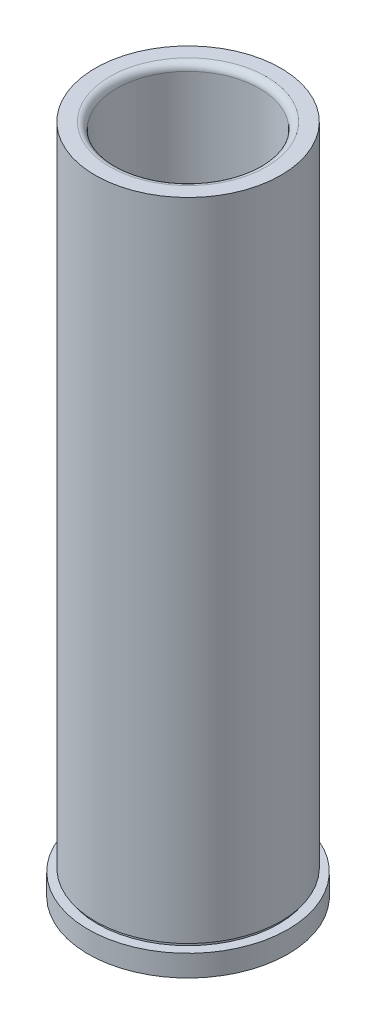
from build123d import *

# Parameters (mm, degrees)
FILLET1_R = 1.524


with BuildPart() as part:
    # Sketch1 → Revolve1 (revolve)
    with BuildSketch(Plane.XY, mode=Mode.PRIVATE) as revolve1_sk:
        with BuildLine():
            Line((-15.88135, 149.225), (-15.88135, 85.725))
            ThreePointArc((-15.88135, 85.725), (-16.779375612, 85.353025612), (-17.15135, 84.455))
            Line((-17.15135, 84.455), (-17.15135, 0.79375))
            Line((-17.15135, 0.79375), (-17.9451, 0))
            Line((-17.9451, 0), (-22.225, 0))
            Line((-22.225, 0), (-22.225, 4.7625))
            Line((-22.225, 4.7625), (-20.13585, 4.7625))
            Line((-20.13585, 4.7625), (-20.13585, 5.5245))
            Line((-20.13585, 5.5245), (-20.64385, 5.5245))
            Line((-20.64385, 5.5245), (-20.64385, 149.225))
            Line((-20.64385, 149.225), (-15.88135, 149.225))
        make_face()
    revolve(revolve1_sk.sketch.rotate(Axis((0, -1000, 0), (0, 1, 0)), 180), axis=Axis((0, -1000, 0), (0, 1, 0)))

    # Fillet1
    fillet1_edges = [part.edges().sort_by_distance(p)[0] for p in [
        (-15.88135, 149.225, 0),
    ]]
    fillet(fillet1_edges, radius=FILLET1_R)


solid = part.part
